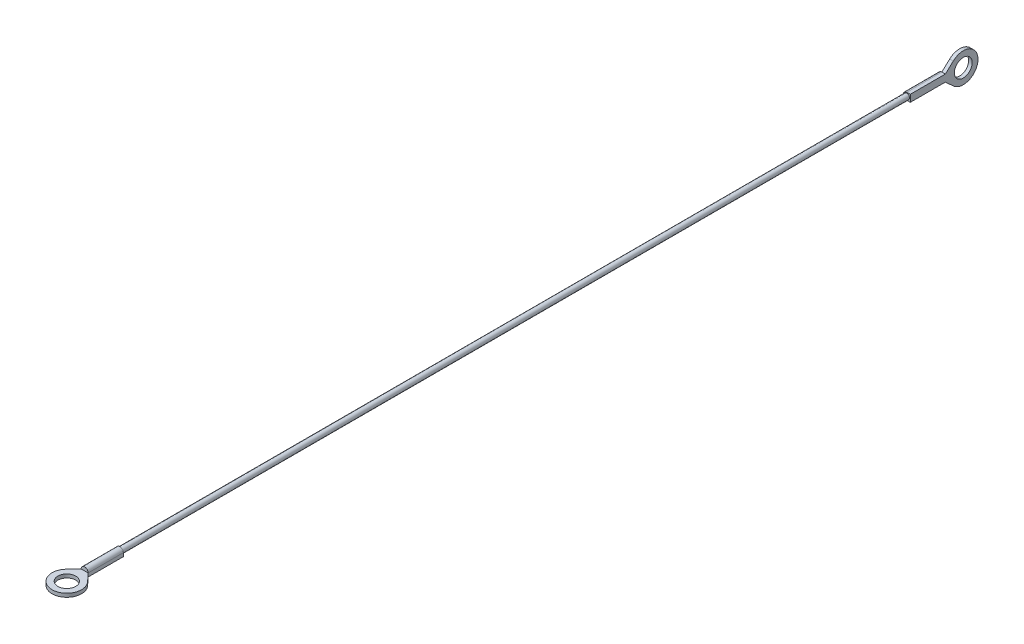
ISO-10303-21;
HEADER;
FILE_DESCRIPTION(('STEP AP214'),'2;1');
FILE_NAME('part.step','',(''),(''),'','','');
FILE_SCHEMA(('AUTOMOTIVE_DESIGN { 1 0 10303 214 1 1 1 1 }'));
ENDSEC;
DATA;
#1=APPLICATION_CONTEXT('core data for automotive mechanical design processes');
#2=APPLICATION_PROTOCOL_DEFINITION('international standard','automotive_design',2000,#1);
#3=PRODUCT_CONTEXT('',#1,'mechanical');
#4=PRODUCT('Part','Part','',(#3));
#5=PRODUCT_RELATED_PRODUCT_CATEGORY('part','',(#4));
#6=PRODUCT_DEFINITION_FORMATION('','',#4);
#7=PRODUCT_DEFINITION_CONTEXT('part definition',#1,'design');
#8=PRODUCT_DEFINITION('design','',#6,#7);
#9=PRODUCT_DEFINITION_SHAPE('','',#8);
#10=(LENGTH_UNIT() NAMED_UNIT(*) SI_UNIT(.MILLI.,.METRE.));
#11=(NAMED_UNIT(*) PLANE_ANGLE_UNIT() SI_UNIT($,.RADIAN.));
#12=(NAMED_UNIT(*) SI_UNIT($,.STERADIAN.) SOLID_ANGLE_UNIT());
#13=UNCERTAINTY_MEASURE_WITH_UNIT(LENGTH_MEASURE(1.E-05),#10,'distance_accuracy_value','');
#14=(GEOMETRIC_REPRESENTATION_CONTEXT(3) GLOBAL_UNCERTAINTY_ASSIGNED_CONTEXT((#13)) GLOBAL_UNIT_ASSIGNED_CONTEXT((#10,
#11,#12)) REPRESENTATION_CONTEXT('',''));
#15=CARTESIAN_POINT('',(0.,0.,0.));
#16=DIRECTION('',(0.,0.,1.));
#17=DIRECTION('',(1.,0.,0.));
#18=AXIS2_PLACEMENT_3D('',#15,#16,#17);
#19=CARTESIAN_POINT('',(0.,0.,-121.92));
#20=DIRECTION('',(0.,0.,-1.));
#21=DIRECTION('',(-1.,0.,0.));
#22=AXIS2_PLACEMENT_3D('',#19,#20,#21);
#23=PLANE('',#22);
#24=CARTESIAN_POINT('',(0.,-0.995,-121.92));
#25=CARTESIAN_POINT('',(-0.411702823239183,-0.995,-121.92));
#26=CARTESIAN_POINT('',(-0.703571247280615,-0.703571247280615,-121.92));
#27=CARTESIAN_POINT('',(-0.994688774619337,-0.412892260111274,-121.92));
#28=CARTESIAN_POINT('',(-0.995,0.,-121.92));
#29=CARTESIAN_POINT('',(-0.995310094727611,0.411392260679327,-121.92));
#30=CARTESIAN_POINT('',(-0.703571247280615,0.703571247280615,-121.92));
#31=CARTESIAN_POINT('',(-0.41258150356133,0.995,-121.92));
#32=CARTESIAN_POINT('',(0.,0.995,-121.92));
#33=B_SPLINE_CURVE_WITH_KNOTS('',2,(#24,#25,#26,#27,#28,#29,#30,#31,#32),.UNSPECIFIED.,.F.,.F.,
(3,2,2,2,3),(0.,0.25,0.5,0.75,1.),.UNSPECIFIED.);
#34=CARTESIAN_POINT('',(-0.00750000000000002,-0.995,-121.92));
#35=VERTEX_POINT('',#34);
#36=CARTESIAN_POINT('',(-0.00750000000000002,0.995,-121.92));
#37=VERTEX_POINT('',#36);
#38=EDGE_CURVE('E180',#35,#37,#33,.T.);
#39=ORIENTED_EDGE('',*,*,#38,.T.);
#40=DIRECTION('',(0.,-1.,0.));
#41=VECTOR('',#40,1.);
#42=CARTESIAN_POINT('',(-0.015,-0.995,-121.92));
#43=LINE('',#42,#41);
#44=EDGE_CURVE('E138',#37,#35,#43,.T.);
#45=ORIENTED_EDGE('',*,*,#44,.T.);
#46=EDGE_LOOP('',(#39,#45));
#47=FACE_BOUND('',#46,.T.);
#48=ADVANCED_FACE('F39',(#47),#23,.T.);
#49=CARTESIAN_POINT('',(0.,0.,121.92));
#50=DIRECTION('',(0.,0.,1.));
#51=DIRECTION('',(1.,0.,0.));
#52=AXIS2_PLACEMENT_3D('',#49,#50,#51);
#53=PLANE('',#52);
#54=CARTESIAN_POINT('',(0.995,0.,121.92));
#55=CARTESIAN_POINT('',(0.995,0.411702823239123,121.92));
#56=CARTESIAN_POINT('',(0.703571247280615,0.703571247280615,121.92));
#57=CARTESIAN_POINT('',(0.412892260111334,0.994688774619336,121.92));
#58=CARTESIAN_POINT('',(0.,0.995,121.92));
#59=CARTESIAN_POINT('',(-0.411392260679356,0.995310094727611,121.92));
#60=CARTESIAN_POINT('',(-0.703571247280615,0.703571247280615,121.92));
#61=CARTESIAN_POINT('',(-0.995,0.412581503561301,121.92));
#62=CARTESIAN_POINT('',(-0.995,0.,121.92));
#63=B_SPLINE_CURVE_WITH_KNOTS('',2,(#54,#55,#56,#57,#58,#59,#60,#61,#62),.UNSPECIFIED.,.F.,.F.,
(3,2,2,2,3),(0.,0.25,0.5,0.75,1.),.UNSPECIFIED.);
#64=CARTESIAN_POINT('',(0.995,0.00749999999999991,121.92));
#65=VERTEX_POINT('',#64);
#66=CARTESIAN_POINT('',(-0.995,0.00749999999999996,121.92));
#67=VERTEX_POINT('',#66);
#68=EDGE_CURVE('E274',#65,#67,#63,.T.);
#69=ORIENTED_EDGE('',*,*,#68,.T.);
#70=DIRECTION('',(1.,0.,0.));
#71=VECTOR('',#70,1.);
#72=CARTESIAN_POINT('',(-0.995,0.015,121.92));
#73=LINE('',#72,#71);
#74=EDGE_CURVE('E228',#67,#65,#73,.T.);
#75=ORIENTED_EDGE('',*,*,#74,.T.);
#76=EDGE_LOOP('',(#69,#75));
#77=FACE_BOUND('',#76,.T.);
#78=ADVANCED_FACE('F251',(#77),#53,.T.);
#79=CARTESIAN_POINT('',(0.,0.,111.92));
#80=DIRECTION('',(0.,0.,-1.));
#81=DIRECTION('',(-1.,0.,0.));
#82=AXIS2_PLACEMENT_3D('',#79,#80,#81);
#83=CYLINDRICAL_SURFACE('',#82,0.795);
#84=CARTESIAN_POINT('',(0.,0.,111.92));
#85=DIRECTION('',(0.,0.,1.));
#86=DIRECTION('',(1.,0.,0.));
#87=AXIS2_PLACEMENT_3D('',#84,#85,#86);
#88=CIRCLE('',#87,0.795);
#89=CARTESIAN_POINT('',(0.795,0.,111.92));
#90=VERTEX_POINT('',#89);
#91=EDGE_CURVE('E11',#90,#90,#88,.T.);
#92=ORIENTED_EDGE('',*,*,#91,.F.);
#93=EDGE_LOOP('',(#92));
#94=FACE_BOUND('',#93,.T.);
#95=CARTESIAN_POINT('',(0.,0.,-111.92));
#96=DIRECTION('',(0.,0.,1.));
#97=DIRECTION('',(1.,0.,0.));
#98=AXIS2_PLACEMENT_3D('',#95,#96,#97);
#99=CIRCLE('',#98,0.795);
#100=CARTESIAN_POINT('',(0.795,0.,-111.92));
#101=VERTEX_POINT('',#100);
#102=EDGE_CURVE('E196',#101,#101,#99,.T.);
#103=ORIENTED_EDGE('',*,*,#102,.T.);
#104=EDGE_LOOP('',(#103));
#105=FACE_BOUND('',#104,.T.);
#106=ADVANCED_FACE('F41',(#94,#105),#83,.T.);
#107=CARTESIAN_POINT('',(0.,0.,121.92));
#108=DIRECTION('',(0.,0.,-1.));
#109=DIRECTION('',(-1.,0.,0.));
#110=AXIS2_PLACEMENT_3D('',#107,#108,#109);
#111=CYLINDRICAL_SURFACE('',#110,0.995);
#112=CARTESIAN_POINT('',(0.,0.,111.92));
#113=DIRECTION('',(0.,0.,1.));
#114=DIRECTION('',(1.,0.,0.));
#115=AXIS2_PLACEMENT_3D('',#112,#113,#114);
#116=CIRCLE('',#115,0.995);
#117=CARTESIAN_POINT('',(0.995,0.,111.92));
#118=VERTEX_POINT('',#117);
#119=CARTESIAN_POINT('',(-0.995,0.,111.92));
#120=VERTEX_POINT('',#119);
#121=EDGE_CURVE('E213',#118,#120,#116,.T.);
#122=ORIENTED_EDGE('',*,*,#121,.T.);
#123=DIRECTION('',(0.,0.,-1.));
#124=VECTOR('',#123,1.);
#125=CARTESIAN_POINT('',(-0.995,0.,121.92));
#126=LINE('',#125,#124);
#127=EDGE_CURVE('E50',#67,#120,#126,.T.);
#128=ORIENTED_EDGE('',*,*,#127,.F.);
#129=ORIENTED_EDGE('',*,*,#68,.F.);
#130=DIRECTION('',(0.,0.,-1.));
#131=VECTOR('',#130,1.);
#132=CARTESIAN_POINT('',(0.995,0.,121.92));
#133=LINE('',#132,#131);
#134=EDGE_CURVE('E489',#65,#118,#133,.T.);
#135=ORIENTED_EDGE('',*,*,#134,.T.);
#136=EDGE_LOOP('',(#122,#128,#129,#135));
#137=FACE_BOUND('',#136,.T.);
#138=ADVANCED_FACE('F280',(#137),#111,.T.);
#139=CARTESIAN_POINT('',(-0.995,0.,121.92));
#140=DIRECTION('',(1.,0.,0.));
#141=DIRECTION('',(0.,1.,0.));
#142=AXIS2_PLACEMENT_3D('',#139,#140,#141);
#143=PLANE('',#142);
#144=DIRECTION('',(0.,-1.,0.));
#145=VECTOR('',#144,1.);
#146=CARTESIAN_POINT('',(-0.995,0.,111.92));
#147=LINE('',#146,#145);
#148=CARTESIAN_POINT('',(-0.995,-0.995,111.92));
#149=VERTEX_POINT('',#148);
#150=EDGE_CURVE('E486',#120,#149,#147,.T.);
#151=ORIENTED_EDGE('',*,*,#150,.T.);
#152=DIRECTION('',(0.,0.,-1.));
#153=VECTOR('',#152,1.);
#154=CARTESIAN_POINT('',(-0.995,-0.995,121.92));
#155=LINE('',#154,#153);
#156=CARTESIAN_POINT('',(-0.995,-0.995,121.92));
#157=VERTEX_POINT('',#156);
#158=EDGE_CURVE('E301',#157,#149,#155,.T.);
#159=ORIENTED_EDGE('',*,*,#158,.F.);
#160=CARTESIAN_POINT('',(-0.994999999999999,0.015,121.92));
#161=DIRECTION('',(0.,-1.,0.));
#162=VECTOR('',#161,1.);
#163=LINE('',#160,#162);
#164=EDGE_CURVE('E222',#67,#157,#163,.T.);
#165=ORIENTED_EDGE('',*,*,#164,.F.);
#166=ORIENTED_EDGE('',*,*,#127,.T.);
#167=EDGE_LOOP('',(#151,#159,#165,#166));
#168=FACE_BOUND('',#167,.T.);
#169=ADVANCED_FACE('F289',(#168),#143,.F.);
#170=CARTESIAN_POINT('',(0.,-0.995,121.92));
#171=DIRECTION('',(0.,1.,0.));
#172=DIRECTION('',(0.,0.,1.));
#173=AXIS2_PLACEMENT_3D('',#170,#171,#172);
#174=PLANE('',#173);
#175=DIRECTION('',(1.,0.,0.));
#176=VECTOR('',#175,1.);
#177=CARTESIAN_POINT('',(0.,-0.995,111.92));
#178=LINE('',#177,#176);
#179=CARTESIAN_POINT('',(0.995,-0.995,111.92));
#180=VERTEX_POINT('',#179);
#181=EDGE_CURVE('E478',#149,#180,#178,.T.);
#182=ORIENTED_EDGE('',*,*,#181,.T.);
#183=DIRECTION('',(0.,0.,-1.));
#184=VECTOR('',#183,1.);
#185=CARTESIAN_POINT('',(0.995,-0.995,121.92));
#186=LINE('',#185,#184);
#187=CARTESIAN_POINT('',(0.995,-0.995,121.92));
#188=VERTEX_POINT('',#187);
#189=EDGE_CURVE('E310',#188,#180,#186,.T.);
#190=ORIENTED_EDGE('',*,*,#189,.F.);
#191=DIRECTION('',(0.681456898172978,0.,0.731858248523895));
#192=VECTOR('',#191,1.);
#193=CARTESIAN_POINT('',(0.995,-0.995,121.92));
#194=LINE('',#193,#192);
#195=CARTESIAN_POINT('',(3.06648606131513,-0.995,124.144695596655));
#196=VERTEX_POINT('',#195);
#197=EDGE_CURVE('E191',#188,#196,#194,.T.);
#198=ORIENTED_EDGE('',*,*,#197,.T.);
#199=CARTESIAN_POINT('',(0.,-0.995,127.));
#200=DIRECTION('',(0.,-1.,0.));
#201=DIRECTION('',(0.,0.,-1.));
#202=AXIS2_PLACEMENT_3D('',#199,#200,#201);
#203=CIRCLE('',#202,4.19);
#204=CARTESIAN_POINT('',(-3.06648606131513,-0.995,124.144695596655));
#205=VERTEX_POINT('',#204);
#206=EDGE_CURVE('E205',#196,#205,#203,.T.);
#207=ORIENTED_EDGE('',*,*,#206,.T.);
#208=DIRECTION('',(0.681456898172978,0.,-0.731858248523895));
#209=VECTOR('',#208,1.);
#210=CARTESIAN_POINT('',(-3.06648606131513,-0.995,124.144695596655));
#211=LINE('',#210,#209);
#212=EDGE_CURVE('E209',#205,#157,#211,.T.);
#213=ORIENTED_EDGE('',*,*,#212,.T.);
#214=ORIENTED_EDGE('',*,*,#158,.T.);
#215=EDGE_LOOP('',(#182,#190,#198,#207,#213,#214));
#216=FACE_BOUND('',#215,.T.);
#217=CARTESIAN_POINT('',(0.,-0.995,127.));
#218=DIRECTION('',(0.,-1.,0.));
#219=DIRECTION('',(0.,0.,-1.));
#220=AXIS2_PLACEMENT_3D('',#217,#218,#219);
#221=CIRCLE('',#220,2.54);
#222=CARTESIAN_POINT('',(0.,-0.995,124.46));
#223=VERTEX_POINT('',#222);
#224=EDGE_CURVE('E192',#223,#223,#221,.T.);
#225=ORIENTED_EDGE('',*,*,#224,.F.);
#226=EDGE_LOOP('',(#225));
#227=FACE_BOUND('',#226,.T.);
#228=ADVANCED_FACE('F293',(#216,#227),#174,.F.);
#229=CARTESIAN_POINT('',(0.995,-0.995,121.92));
#230=DIRECTION('',(-1.,0.,0.));
#231=DIRECTION('',(0.,-1.,0.));
#232=AXIS2_PLACEMENT_3D('',#229,#230,#231);
#233=PLANE('',#232);
#234=DIRECTION('',(0.,1.,0.));
#235=VECTOR('',#234,1.);
#236=CARTESIAN_POINT('',(0.995,-0.995,111.92));
#237=LINE('',#236,#235);
#238=EDGE_CURVE('E485',#180,#118,#237,.T.);
#239=ORIENTED_EDGE('',*,*,#238,.T.);
#240=ORIENTED_EDGE('',*,*,#134,.F.);
#241=DIRECTION('',(0.,1.,0.));
#242=VECTOR('',#241,1.);
#243=CARTESIAN_POINT('',(0.995,-0.995,121.92));
#244=LINE('',#243,#242);
#245=EDGE_CURVE('E278',#188,#65,#244,.T.);
#246=ORIENTED_EDGE('',*,*,#245,.F.);
#247=ORIENTED_EDGE('',*,*,#189,.T.);
#248=EDGE_LOOP('',(#239,#240,#246,#247));
#249=FACE_BOUND('',#248,.T.);
#250=ADVANCED_FACE('F471',(#249),#233,.F.);
#251=CARTESIAN_POINT('',(0.,0.,111.92));
#252=DIRECTION('',(0.,0.,1.));
#253=DIRECTION('',(1.,0.,0.));
#254=AXIS2_PLACEMENT_3D('',#251,#252,#253);
#255=PLANE('',#254);
#256=ORIENTED_EDGE('',*,*,#91,.T.);
#257=EDGE_LOOP('',(#256));
#258=FACE_BOUND('',#257,.T.);
#259=ORIENTED_EDGE('',*,*,#121,.F.);
#260=ORIENTED_EDGE('',*,*,#238,.F.);
#261=ORIENTED_EDGE('',*,*,#181,.F.);
#262=ORIENTED_EDGE('',*,*,#150,.F.);
#263=EDGE_LOOP('',(#259,#260,#261,#262));
#264=FACE_BOUND('',#263,.T.);
#265=ADVANCED_FACE('F241',(#258,#264),#255,.F.);
#266=CARTESIAN_POINT('',(-3.06648606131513,0.015,124.144695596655));
#267=DIRECTION('',(-0.731858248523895,0.,-0.681456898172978));
#268=DIRECTION('',(-0.681456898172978,0.,0.731858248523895));
#269=AXIS2_PLACEMENT_3D('',#266,#267,#268);
#270=PLANE('',#269);
#271=ORIENTED_EDGE('',*,*,#212,.F.);
#272=DIRECTION('',(0.,-1.,0.));
#273=VECTOR('',#272,1.);
#274=CARTESIAN_POINT('',(-3.06648606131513,0.015,124.144695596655));
#275=LINE('',#274,#273);
#276=CARTESIAN_POINT('',(-3.06648606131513,0.015,124.144695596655));
#277=VERTEX_POINT('',#276);
#278=EDGE_CURVE('E210',#277,#205,#275,.T.);
#279=ORIENTED_EDGE('',*,*,#278,.F.);
#280=DIRECTION('',(0.681456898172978,0.,-0.731858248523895));
#281=VECTOR('',#280,1.);
#282=CARTESIAN_POINT('',(-3.06648606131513,0.015,124.144695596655));
#283=LINE('',#282,#281);
#284=EDGE_CURVE('E201',#277,#67,#283,.T.);
#285=ORIENTED_EDGE('',*,*,#284,.T.);
#286=ORIENTED_EDGE('',*,*,#164,.T.);
#287=EDGE_LOOP('',(#271,#279,#285,#286));
#288=FACE_BOUND('',#287,.T.);
#289=ADVANCED_FACE('F230',(#288),#270,.T.);
#290=CARTESIAN_POINT('',(0.,0.015,127.));
#291=DIRECTION('',(0.,-1.,0.));
#292=DIRECTION('',(0.,0.,-1.));
#293=AXIS2_PLACEMENT_3D('',#290,#291,#292);
#294=CYLINDRICAL_SURFACE('',#293,4.19);
#295=ORIENTED_EDGE('',*,*,#206,.F.);
#296=DIRECTION('',(0.,-1.,0.));
#297=VECTOR('',#296,1.);
#298=CARTESIAN_POINT('',(3.06648606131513,0.015,124.144695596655));
#299=LINE('',#298,#297);
#300=CARTESIAN_POINT('',(3.06648606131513,0.015,124.144695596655));
#301=VERTEX_POINT('',#300);
#302=EDGE_CURVE('E214',#301,#196,#299,.T.);
#303=ORIENTED_EDGE('',*,*,#302,.F.);
#304=CARTESIAN_POINT('',(0.,0.015,127.));
#305=DIRECTION('',(0.,-1.,0.));
#306=DIRECTION('',(0.,0.,-1.));
#307=AXIS2_PLACEMENT_3D('',#304,#305,#306);
#308=CIRCLE('',#307,4.19);
#309=EDGE_CURVE('E197',#301,#277,#308,.T.);
#310=ORIENTED_EDGE('',*,*,#309,.T.);
#311=ORIENTED_EDGE('',*,*,#278,.T.);
#312=EDGE_LOOP('',(#295,#303,#310,#311));
#313=FACE_BOUND('',#312,.T.);
#314=ADVANCED_FACE('F240',(#313),#294,.T.);
#315=CARTESIAN_POINT('',(0.995,0.015,121.92));
#316=DIRECTION('',(0.731858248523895,0.,-0.681456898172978));
#317=DIRECTION('',(-0.681456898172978,0.,-0.731858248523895));
#318=AXIS2_PLACEMENT_3D('',#315,#316,#317);
#319=PLANE('',#318);
#320=ORIENTED_EDGE('',*,*,#197,.F.);
#321=ORIENTED_EDGE('',*,*,#245,.T.);
#322=DIRECTION('',(0.681456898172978,0.,0.731858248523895));
#323=VECTOR('',#322,1.);
#324=CARTESIAN_POINT('',(0.995,0.015,121.92));
#325=LINE('',#324,#323);
#326=EDGE_CURVE('E58',#65,#301,#325,.T.);
#327=ORIENTED_EDGE('',*,*,#326,.T.);
#328=ORIENTED_EDGE('',*,*,#302,.T.);
#329=EDGE_LOOP('',(#320,#321,#327,#328));
#330=FACE_BOUND('',#329,.T.);
#331=ADVANCED_FACE('F246',(#330),#319,.T.);
#332=CARTESIAN_POINT('',(0.,0.015,127.));
#333=DIRECTION('',(0.,-1.,0.));
#334=DIRECTION('',(0.,0.,-1.));
#335=AXIS2_PLACEMENT_3D('',#332,#333,#334);
#336=PLANE('',#335);
#337=CARTESIAN_POINT('',(0.,0.015,127.));
#338=DIRECTION('',(0.,-1.,0.));
#339=DIRECTION('',(0.,0.,-1.));
#340=AXIS2_PLACEMENT_3D('',#337,#338,#339);
#341=CIRCLE('',#340,2.54);
#342=CARTESIAN_POINT('',(0.,0.015,124.46));
#343=VERTEX_POINT('',#342);
#344=EDGE_CURVE('E187',#343,#343,#341,.T.);
#345=ORIENTED_EDGE('',*,*,#344,.T.);
#346=EDGE_LOOP('',(#345));
#347=FACE_BOUND('',#346,.T.);
#348=ORIENTED_EDGE('',*,*,#74,.F.);
#349=ORIENTED_EDGE('',*,*,#284,.F.);
#350=ORIENTED_EDGE('',*,*,#309,.F.);
#351=ORIENTED_EDGE('',*,*,#326,.F.);
#352=EDGE_LOOP('',(#348,#349,#350,#351));
#353=FACE_BOUND('',#352,.T.);
#354=ADVANCED_FACE('F242',(#347,#353),#336,.F.);
#355=CARTESIAN_POINT('',(0.,0.015,127.));
#356=DIRECTION('',(0.,-1.,0.));
#357=DIRECTION('',(0.,0.,-1.));
#358=AXIS2_PLACEMENT_3D('',#355,#356,#357);
#359=CYLINDRICAL_SURFACE('',#358,2.54);
#360=ORIENTED_EDGE('',*,*,#344,.F.);
#361=EDGE_LOOP('',(#360));
#362=FACE_BOUND('',#361,.T.);
#363=ORIENTED_EDGE('',*,*,#224,.T.);
#364=EDGE_LOOP('',(#363));
#365=FACE_BOUND('',#364,.T.);
#366=ADVANCED_FACE('F457',(#362,#365),#359,.F.);
#367=CARTESIAN_POINT('',(0.,0.,-121.92));
#368=DIRECTION('',(0.,0.,1.));
#369=DIRECTION('',(1.,0.,0.));
#370=AXIS2_PLACEMENT_3D('',#367,#368,#369);
#371=CYLINDRICAL_SURFACE('',#370,0.995);
#372=CARTESIAN_POINT('',(0.,0.,-111.92));
#373=DIRECTION('',(0.,0.,-1.));
#374=DIRECTION('',(-1.,0.,0.));
#375=AXIS2_PLACEMENT_3D('',#372,#373,#374);
#376=CIRCLE('',#375,0.995);
#377=CARTESIAN_POINT('',(0.,-0.995,-111.92));
#378=VERTEX_POINT('',#377);
#379=CARTESIAN_POINT('',(0.,0.995,-111.92));
#380=VERTEX_POINT('',#379);
#381=EDGE_CURVE('E166',#378,#380,#376,.T.);
#382=ORIENTED_EDGE('',*,*,#381,.T.);
#383=DIRECTION('',(0.,0.,1.));
#384=VECTOR('',#383,1.);
#385=CARTESIAN_POINT('',(0.,0.995,-121.92));
#386=LINE('',#385,#384);
#387=EDGE_CURVE('E365',#37,#380,#386,.T.);
#388=ORIENTED_EDGE('',*,*,#387,.F.);
#389=ORIENTED_EDGE('',*,*,#38,.F.);
#390=DIRECTION('',(0.,0.,1.));
#391=VECTOR('',#390,1.);
#392=CARTESIAN_POINT('',(0.,-0.995,-121.92));
#393=LINE('',#392,#391);
#394=EDGE_CURVE('E186',#35,#378,#393,.T.);
#395=ORIENTED_EDGE('',*,*,#394,.T.);
#396=EDGE_LOOP('',(#382,#388,#389,#395));
#397=FACE_BOUND('',#396,.T.);
#398=ADVANCED_FACE('F349',(#397),#371,.T.);
#399=CARTESIAN_POINT('',(0.,0.995,-121.92));
#400=DIRECTION('',(0.,-1.,0.));
#401=DIRECTION('',(0.,0.,-1.));
#402=AXIS2_PLACEMENT_3D('',#399,#400,#401);
#403=PLANE('',#402);
#404=DIRECTION('',(1.,0.,0.));
#405=VECTOR('',#404,1.);
#406=CARTESIAN_POINT('',(0.,0.995,-111.92));
#407=LINE('',#406,#405);
#408=CARTESIAN_POINT('',(0.995,0.995,-111.92));
#409=VERTEX_POINT('',#408);
#410=EDGE_CURVE('E170',#380,#409,#407,.T.);
#411=ORIENTED_EDGE('',*,*,#410,.T.);
#412=DIRECTION('',(0.,0.,1.));
#413=VECTOR('',#412,1.);
#414=CARTESIAN_POINT('',(0.995,0.995,-121.92));
#415=LINE('',#414,#413);
#416=CARTESIAN_POINT('',(0.995,0.995,-121.92));
#417=VERTEX_POINT('',#416);
#418=EDGE_CURVE('E185',#417,#409,#415,.T.);
#419=ORIENTED_EDGE('',*,*,#418,.F.);
#420=CARTESIAN_POINT('',(-0.015,0.995,-121.92));
#421=DIRECTION('',(1.,0.,0.));
#422=VECTOR('',#421,1.);
#423=LINE('',#420,#422);
#424=EDGE_CURVE('E384',#37,#417,#423,.T.);
#425=ORIENTED_EDGE('',*,*,#424,.F.);
#426=ORIENTED_EDGE('',*,*,#387,.T.);
#427=EDGE_LOOP('',(#411,#419,#425,#426));
#428=FACE_BOUND('',#427,.T.);
#429=ADVANCED_FACE('F344',(#428),#403,.F.);
#430=CARTESIAN_POINT('',(0.995,0.,-121.92));
#431=DIRECTION('',(-1.,0.,0.));
#432=DIRECTION('',(0.,-1.,0.));
#433=AXIS2_PLACEMENT_3D('',#430,#431,#432);
#434=PLANE('',#433);
#435=DIRECTION('',(0.,-1.,0.));
#436=VECTOR('',#435,1.);
#437=CARTESIAN_POINT('',(0.995,0.,-111.92));
#438=LINE('',#437,#436);
#439=CARTESIAN_POINT('',(0.995,-0.995,-111.92));
#440=VERTEX_POINT('',#439);
#441=EDGE_CURVE('E174',#409,#440,#438,.T.);
#442=ORIENTED_EDGE('',*,*,#441,.T.);
#443=DIRECTION('',(0.,0.,1.));
#444=VECTOR('',#443,1.);
#445=CARTESIAN_POINT('',(0.995,-0.995,-121.92));
#446=LINE('',#445,#444);
#447=CARTESIAN_POINT('',(0.995,-0.995,-121.92));
#448=VERTEX_POINT('',#447);
#449=EDGE_CURVE('E181',#448,#440,#446,.T.);
#450=ORIENTED_EDGE('',*,*,#449,.F.);
#451=DIRECTION('',(0.,-0.681456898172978,-0.731858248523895));
#452=VECTOR('',#451,1.);
#453=CARTESIAN_POINT('',(0.995,-3.06648606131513,-124.144695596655));
#454=LINE('',#453,#452);
#455=CARTESIAN_POINT('',(0.995,-3.06648606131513,-124.144695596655));
#456=VERTEX_POINT('',#455);
#457=EDGE_CURVE('E435',#448,#456,#454,.T.);
#458=ORIENTED_EDGE('',*,*,#457,.T.);
#459=CARTESIAN_POINT('',(0.995,0.,-127.));
#460=DIRECTION('',(1.,0.,0.));
#461=DIRECTION('',(0.,0.,1.));
#462=AXIS2_PLACEMENT_3D('',#459,#460,#461);
#463=CIRCLE('',#462,4.19);
#464=CARTESIAN_POINT('',(0.995,3.06648606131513,-124.144695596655));
#465=VERTEX_POINT('',#464);
#466=EDGE_CURVE('E132',#456,#465,#463,.T.);
#467=ORIENTED_EDGE('',*,*,#466,.T.);
#468=DIRECTION('',(0.,-0.681456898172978,0.731858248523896));
#469=VECTOR('',#468,1.);
#470=CARTESIAN_POINT('',(0.995,0.995,-121.92));
#471=LINE('',#470,#469);
#472=EDGE_CURVE('E155',#465,#417,#471,.T.);
#473=ORIENTED_EDGE('',*,*,#472,.T.);
#474=ORIENTED_EDGE('',*,*,#418,.T.);
#475=EDGE_LOOP('',(#442,#450,#458,#467,#473,#474));
#476=FACE_BOUND('',#475,.T.);
#477=CARTESIAN_POINT('',(0.995,0.,-127.));
#478=DIRECTION('',(1.,0.,0.));
#479=DIRECTION('',(0.,0.,-1.));
#480=AXIS2_PLACEMENT_3D('',#477,#478,#479);
#481=CIRCLE('',#480,2.53999999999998);
#482=CARTESIAN_POINT('',(0.995,0.,-129.54));
#483=VERTEX_POINT('',#482);
#484=EDGE_CURVE('E436',#483,#483,#481,.T.);
#485=ORIENTED_EDGE('',*,*,#484,.F.);
#486=EDGE_LOOP('',(#485));
#487=FACE_BOUND('',#486,.T.);
#488=ADVANCED_FACE('F340',(#476,#487),#434,.F.);
#489=CARTESIAN_POINT('',(0.995,-0.995,-121.92));
#490=DIRECTION('',(0.,1.,0.));
#491=DIRECTION('',(0.,0.,1.));
#492=AXIS2_PLACEMENT_3D('',#489,#490,#491);
#493=PLANE('',#492);
#494=DIRECTION('',(-1.,0.,0.));
#495=VECTOR('',#494,1.);
#496=CARTESIAN_POINT('',(0.995,-0.995,-111.92));
#497=LINE('',#496,#495);
#498=EDGE_CURVE('E177',#440,#378,#497,.T.);
#499=ORIENTED_EDGE('',*,*,#498,.T.);
#500=ORIENTED_EDGE('',*,*,#394,.F.);
#501=DIRECTION('',(-1.,0.,0.));
#502=VECTOR('',#501,1.);
#503=CARTESIAN_POINT('',(0.995,-0.995,-121.92));
#504=LINE('',#503,#502);
#505=EDGE_CURVE('E152',#448,#35,#504,.T.);
#506=ORIENTED_EDGE('',*,*,#505,.F.);
#507=ORIENTED_EDGE('',*,*,#449,.T.);
#508=EDGE_LOOP('',(#499,#500,#506,#507));
#509=FACE_BOUND('',#508,.T.);
#510=ADVANCED_FACE('F336',(#509),#493,.F.);
#511=CARTESIAN_POINT('',(0.,0.,-111.92));
#512=DIRECTION('',(0.,0.,-1.));
#513=DIRECTION('',(-1.,0.,0.));
#514=AXIS2_PLACEMENT_3D('',#511,#512,#513);
#515=PLANE('',#514);
#516=ORIENTED_EDGE('',*,*,#102,.F.);
#517=EDGE_LOOP('',(#516));
#518=FACE_BOUND('',#517,.T.);
#519=ORIENTED_EDGE('',*,*,#381,.F.);
#520=ORIENTED_EDGE('',*,*,#498,.F.);
#521=ORIENTED_EDGE('',*,*,#441,.F.);
#522=ORIENTED_EDGE('',*,*,#410,.F.);
#523=EDGE_LOOP('',(#519,#520,#521,#522));
#524=FACE_BOUND('',#523,.T.);
#525=ADVANCED_FACE('F333',(#518,#524),#515,.F.);
#526=CARTESIAN_POINT('',(-0.015,-3.06648606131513,-124.144695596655));
#527=DIRECTION('',(0.,-0.731858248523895,0.681456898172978));
#528=DIRECTION('',(0.,-0.681456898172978,-0.731858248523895));
#529=AXIS2_PLACEMENT_3D('',#526,#527,#528);
#530=PLANE('',#529);
#531=ORIENTED_EDGE('',*,*,#457,.F.);
#532=ORIENTED_EDGE('',*,*,#505,.T.);
#533=DIRECTION('',(0.,-0.681456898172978,-0.731858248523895));
#534=VECTOR('',#533,1.);
#535=CARTESIAN_POINT('',(-0.015,-3.06648606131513,-124.144695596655));
#536=LINE('',#535,#534);
#537=CARTESIAN_POINT('',(-0.015,-3.06648606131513,-124.144695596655));
#538=VERTEX_POINT('',#537);
#539=EDGE_CURVE('E145',#35,#538,#536,.T.);
#540=ORIENTED_EDGE('',*,*,#539,.T.);
#541=DIRECTION('',(1.,0.,0.));
#542=VECTOR('',#541,1.);
#543=CARTESIAN_POINT('',(-0.015,-3.06648606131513,-124.144695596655));
#544=LINE('',#543,#542);
#545=EDGE_CURVE('E127',#538,#456,#544,.T.);
#546=ORIENTED_EDGE('',*,*,#545,.T.);
#547=EDGE_LOOP('',(#531,#532,#540,#546));
#548=FACE_BOUND('',#547,.T.);
#549=ADVANCED_FACE('F150',(#548),#530,.T.);
#550=CARTESIAN_POINT('',(-0.015,0.995,-121.92));
#551=DIRECTION('',(0.,0.731858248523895,0.681456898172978));
#552=DIRECTION('',(0.,-0.681456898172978,0.731858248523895));
#553=AXIS2_PLACEMENT_3D('',#550,#551,#552);
#554=PLANE('',#553);
#555=ORIENTED_EDGE('',*,*,#472,.F.);
#556=DIRECTION('',(1.,0.,0.));
#557=VECTOR('',#556,1.);
#558=CARTESIAN_POINT('',(-0.015,3.06648606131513,-124.144695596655));
#559=LINE('',#558,#557);
#560=CARTESIAN_POINT('',(-0.015,3.06648606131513,-124.144695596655));
#561=VERTEX_POINT('',#560);
#562=EDGE_CURVE('E137',#561,#465,#559,.T.);
#563=ORIENTED_EDGE('',*,*,#562,.F.);
#564=DIRECTION('',(0.,-0.681456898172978,0.731858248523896));
#565=VECTOR('',#564,1.);
#566=CARTESIAN_POINT('',(-0.015,0.995,-121.92));
#567=LINE('',#566,#565);
#568=EDGE_CURVE('E147',#561,#37,#567,.T.);
#569=ORIENTED_EDGE('',*,*,#568,.T.);
#570=ORIENTED_EDGE('',*,*,#424,.T.);
#571=EDGE_LOOP('',(#555,#563,#569,#570));
#572=FACE_BOUND('',#571,.T.);
#573=ADVANCED_FACE('F411',(#572),#554,.T.);
#574=CARTESIAN_POINT('',(-0.015,0.,-127.));
#575=DIRECTION('',(1.,0.,0.));
#576=DIRECTION('',(0.,0.,-1.));
#577=AXIS2_PLACEMENT_3D('',#574,#575,#576);
#578=CYLINDRICAL_SURFACE('',#577,4.19);
#579=ORIENTED_EDGE('',*,*,#466,.F.);
#580=ORIENTED_EDGE('',*,*,#545,.F.);
#581=CARTESIAN_POINT('',(-0.015,0.,-127.));
#582=DIRECTION('',(1.,0.,0.));
#583=DIRECTION('',(0.,0.,1.));
#584=AXIS2_PLACEMENT_3D('',#581,#582,#583);
#585=CIRCLE('',#584,4.19);
#586=EDGE_CURVE('E130',#538,#561,#585,.T.);
#587=ORIENTED_EDGE('',*,*,#586,.T.);
#588=ORIENTED_EDGE('',*,*,#562,.T.);
#589=EDGE_LOOP('',(#579,#580,#587,#588));
#590=FACE_BOUND('',#589,.T.);
#591=ADVANCED_FACE('F129',(#590),#578,.T.);
#592=CARTESIAN_POINT('',(-0.015,0.,-127.));
#593=DIRECTION('',(-1.,0.,0.));
#594=DIRECTION('',(0.,0.,1.));
#595=AXIS2_PLACEMENT_3D('',#592,#593,#594);
#596=PLANE('',#595);
#597=CARTESIAN_POINT('',(-0.015,0.,-127.));
#598=DIRECTION('',(1.,0.,0.));
#599=DIRECTION('',(0.,0.,-1.));
#600=AXIS2_PLACEMENT_3D('',#597,#598,#599);
#601=CIRCLE('',#600,2.53999999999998);
#602=CARTESIAN_POINT('',(-0.015,0.,-129.54));
#603=VERTEX_POINT('',#602);
#604=EDGE_CURVE('E433',#603,#603,#601,.T.);
#605=ORIENTED_EDGE('',*,*,#604,.T.);
#606=EDGE_LOOP('',(#605));
#607=FACE_BOUND('',#606,.T.);
#608=ORIENTED_EDGE('',*,*,#539,.F.);
#609=ORIENTED_EDGE('',*,*,#44,.F.);
#610=ORIENTED_EDGE('',*,*,#568,.F.);
#611=ORIENTED_EDGE('',*,*,#586,.F.);
#612=EDGE_LOOP('',(#608,#609,#610,#611));
#613=FACE_BOUND('',#612,.T.);
#614=ADVANCED_FACE('F143',(#607,#613),#596,.T.);
#615=CARTESIAN_POINT('',(-0.015,0.,-127.));
#616=DIRECTION('',(1.,0.,0.));
#617=DIRECTION('',(0.,0.,-1.));
#618=AXIS2_PLACEMENT_3D('',#615,#616,#617);
#619=CYLINDRICAL_SURFACE('',#618,2.53999999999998);
#620=ORIENTED_EDGE('',*,*,#604,.F.);
#621=EDGE_LOOP('',(#620));
#622=FACE_BOUND('',#621,.T.);
#623=ORIENTED_EDGE('',*,*,#484,.T.);
#624=EDGE_LOOP('',(#623));
#625=FACE_BOUND('',#624,.T.);
#626=ADVANCED_FACE('F425',(#622,#625),#619,.F.);
#627=CLOSED_SHELL('',(#48,#78,#106,#138,#169,#228,#250,#265,#289,#314,#331,#354,#366,#398,#429,
#488,#510,#525,#549,#573,#591,#614,#626));
#628=MANIFOLD_SOLID_BREP('B2',#627);
#629=ADVANCED_BREP_SHAPE_REPRESENTATION('',(#18,#628),#14);
#630=SHAPE_DEFINITION_REPRESENTATION(#9,#629);
ENDSEC;
END-ISO-10303-21;
